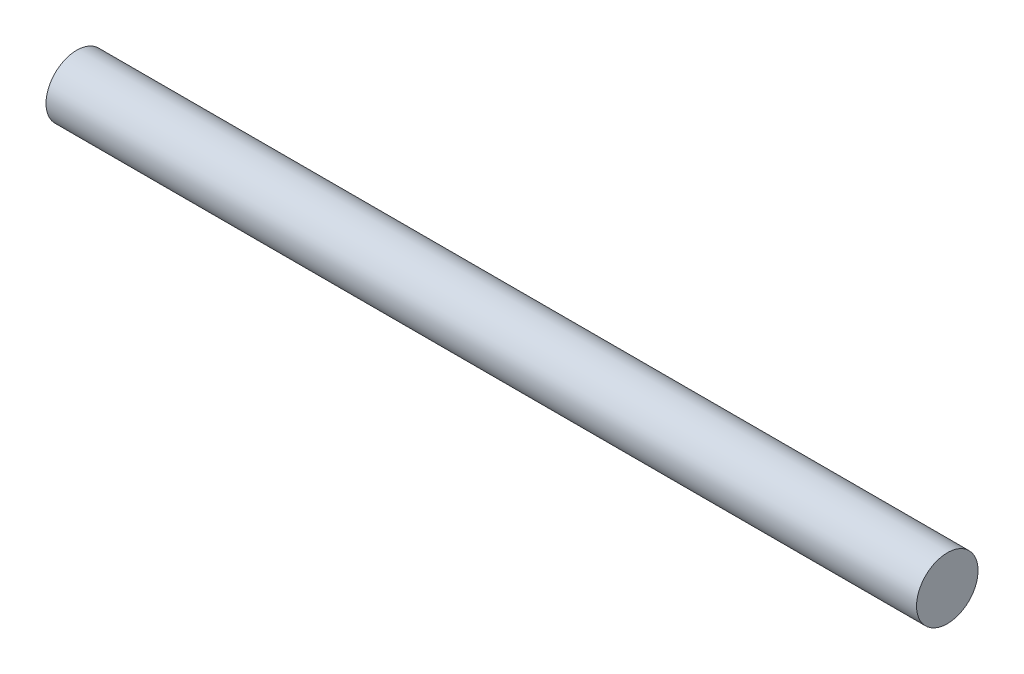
from build123d import *

# Parameters (mm, degrees)
ESQUISSE1_W = 141.513720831
ESQUISSE1_H = 5


with BuildPart() as part:
    # Esquisse1 → Base-R_volution (revolve)
    with BuildSketch(Plane.XY, mode=Mode.PRIVATE) as base_r_volution_sk:
        with Locations((27.471812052, 1.5)):
            Rectangle(ESQUISSE1_W, ESQUISSE1_H)
    revolve(base_r_volution_sk.sketch.rotate(Axis((-40, -1, 0), (1, 0, 0)), 90), axis=Axis((-40, -1, 0), (1, 0, 0)))


solid = part.part
